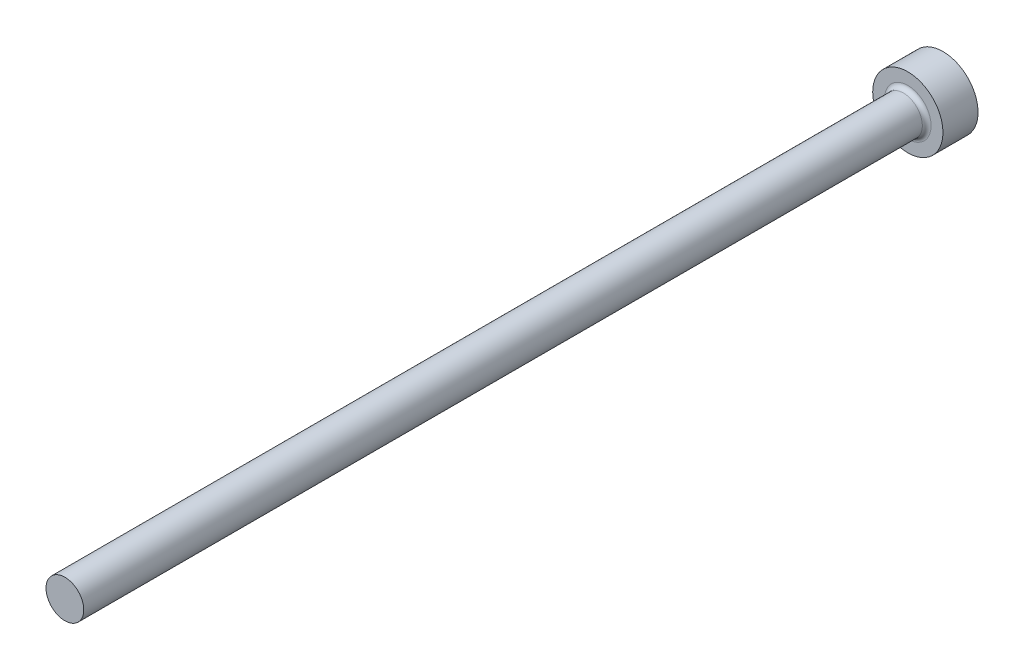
from build123d import *

# Parameters (mm, degrees)
FILLET1_R = 0.5


with BuildPart() as part:
    # FV → Revolve1 (revolve)
    with BuildSketch(Plane(origin=(0, 0, 0), x_dir=(1, 0, 0), z_dir=(0, 1, 0)), mode=Mode.PRIVATE) as revolve1_sk:
        Polygon((0, 0), (4, 0), (4, -4), (2.15, -4), (2.15, -100), (0, -100), align=None)
    revolve(revolve1_sk.sketch.rotate(Axis((0, 0, -9.033228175), (0, 0, 1)), 180), axis=Axis((0, 0, -9.033228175), (0, 0, 1)))

    # Fillet1
    fillet1_edges = [part.edges().sort_by_distance(p)[0] for p in [
        (2.15, 0, 4),
    ]]
    fillet(fillet1_edges, radius=FILLET1_R)


solid = part.part
